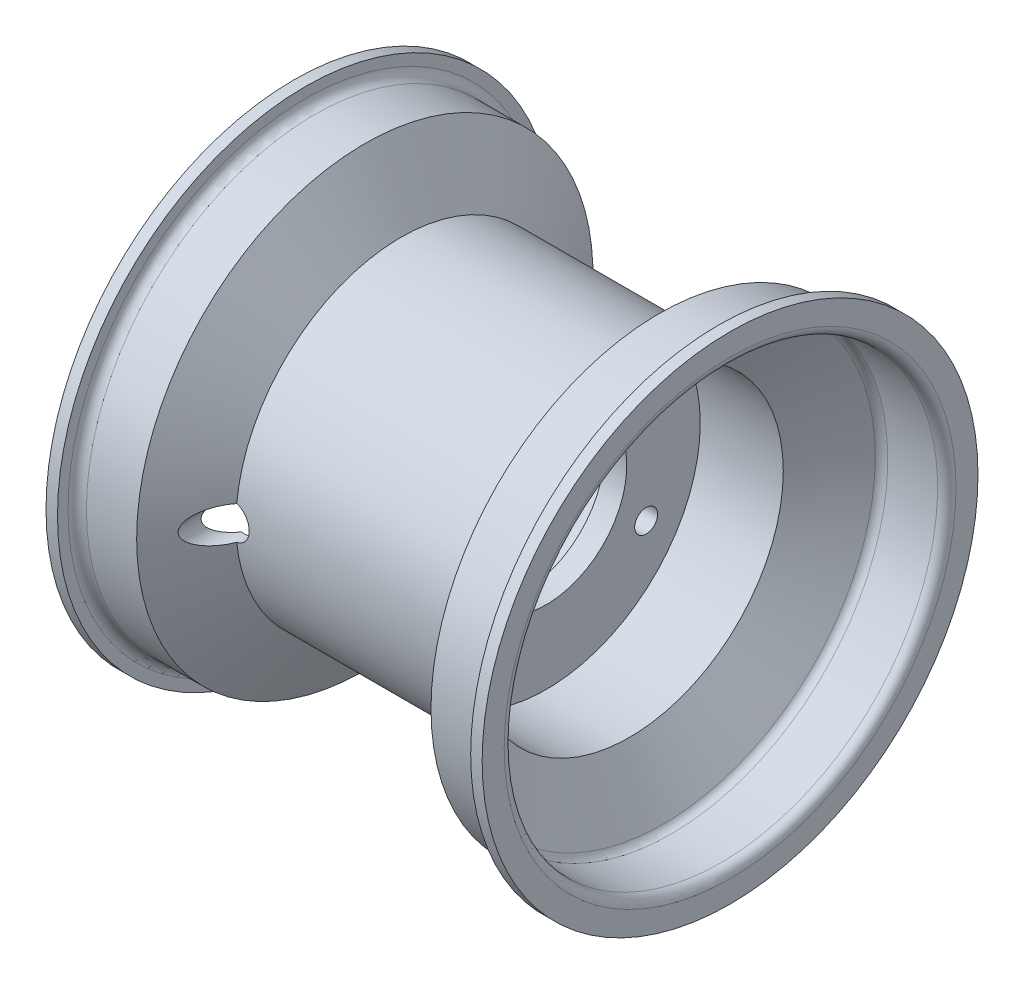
from build123d import *

# Parameters (mm, degrees)
SKETCH2_R          = 3.175
CUT_EXTRUDE1_DEPTH = 25.4
SKETCH3_R          = 4.7625
CUT_EXTRUDE2_DEPTH = 71.12


with BuildPart() as part:
    # Sketch1 → Revolve1 (revolve)
    with BuildSketch(Plane.XY, mode=Mode.PRIVATE) as revolve1_sk:
        with BuildLine():
            Line((-60.325, 68.58), (-57.15, 68.58))
            Line((-57.15, 68.58), (-57.15, 65.659))
            ThreePointArc((-57.15, 65.659), (-56.406051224, 63.862948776), (-54.61, 63.119))
            Line((-54.61, 63.119), (-40.711912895, 63.119))
            Line((-40.711912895, 63.119), (-30.666595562, 45.72))
            Line((-30.666595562, 45.72), (30.666595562, 45.72))
            Line((30.666595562, 45.72), (40.711912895, 63.119))
            Line((40.711912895, 63.119), (54.61, 63.119))
            ThreePointArc((54.61, 63.119), (56.406051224, 63.862948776), (57.15, 65.659))
            Line((57.15, 65.659), (57.15, 68.58))
            Line((57.15, 68.58), (60.325, 68.58))
            Line((60.325, 68.58), (60.325, 62.484))
            ThreePointArc((60.325, 62.484), (59.581051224, 60.687948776), (57.785, 59.944))
            Line((57.785, 59.944), (44.011469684, 59.944))
            ThreePointArc((44.011469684, 59.944), (42.741469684, 59.603704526), (41.811765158, 58.674))
            Line((41.811765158, 58.674), (32.499682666, 42.545))
            Line((32.499682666, 42.545), (9.525, 42.545))
            Line((9.525, 42.545), (9.525, 22.225))
            Line((9.525, 22.225), (3.302, 22.225))
            Line((3.302, 22.225), (3.302, 42.545))
            Line((3.302, 42.545), (-32.499682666, 42.545))
            Line((-32.499682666, 42.545), (-41.811765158, 58.674))
            ThreePointArc((-41.811765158, 58.674), (-42.741469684, 59.603704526), (-44.011469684, 59.944))
            Line((-44.011469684, 59.944), (-57.785, 59.944))
            ThreePointArc((-57.785, 59.944), (-59.581051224, 60.687948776), (-60.325, 62.484))
            Line((-60.325, 62.484), (-60.325, 68.58))
        make_face()
    revolve(revolve1_sk.sketch.rotate(Axis((0, 0, 0), (1, 0, 0)), 90), axis=Axis((0, 0, 0), (1, 0, 0)))

    # Sketch2 → Cut-Extrude1 (cut, symmetric)
    with BuildSketch(Plane(origin=(0, 0, 0), x_dir=(0, 0, -1), z_dir=(1, 0, 0))):
        with Locations((0, 31.8516)):
            Circle(SKETCH2_R)
        with Locations((27.584294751, -15.9258)):
            Circle(SKETCH2_R)
        with Locations((-27.584294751, -15.9258)):
            Circle(SKETCH2_R)
    extrude(amount=CUT_EXTRUDE1_DEPTH, both=True, mode=Mode.SUBTRACT)

    # Sketch3 → Cut-Extrude2 (cut)
    with BuildSketch(Plane.XY):
        with Locations(Location((-31.75, 0, 0), (0, 0, 180))):
            Circle(SKETCH3_R)
    extrude(amount=CUT_EXTRUDE2_DEPTH, mode=Mode.SUBTRACT)


solid = part.part
